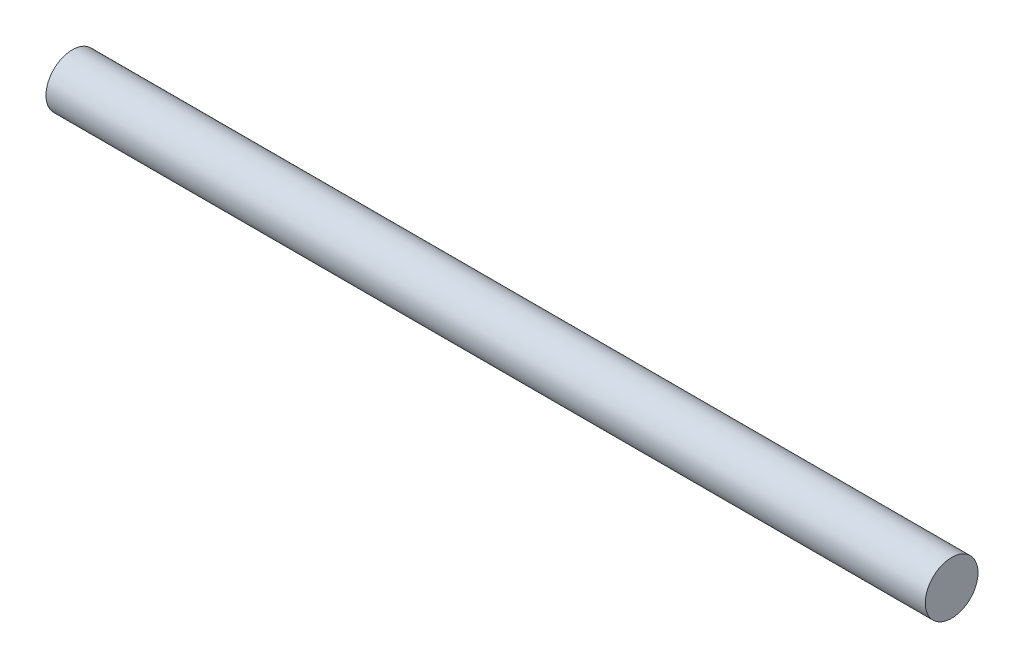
from build123d import *

# Parameters (mm, degrees)
SKETCH1_R           = 0.9
BOSS_EXTRUDE1_DEPTH = 30


with BuildPart() as part:
    # Sketch1 → Boss-Extrude1 (new body)
    with BuildSketch(Plane(origin=(0, 0, 0), x_dir=(0, 0, -1), z_dir=(1, 0, 0))):
        with Locations((10.870319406, -21.876517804)):
            Circle(SKETCH1_R)
    extrude(amount=BOSS_EXTRUDE1_DEPTH)


solid = part.part
